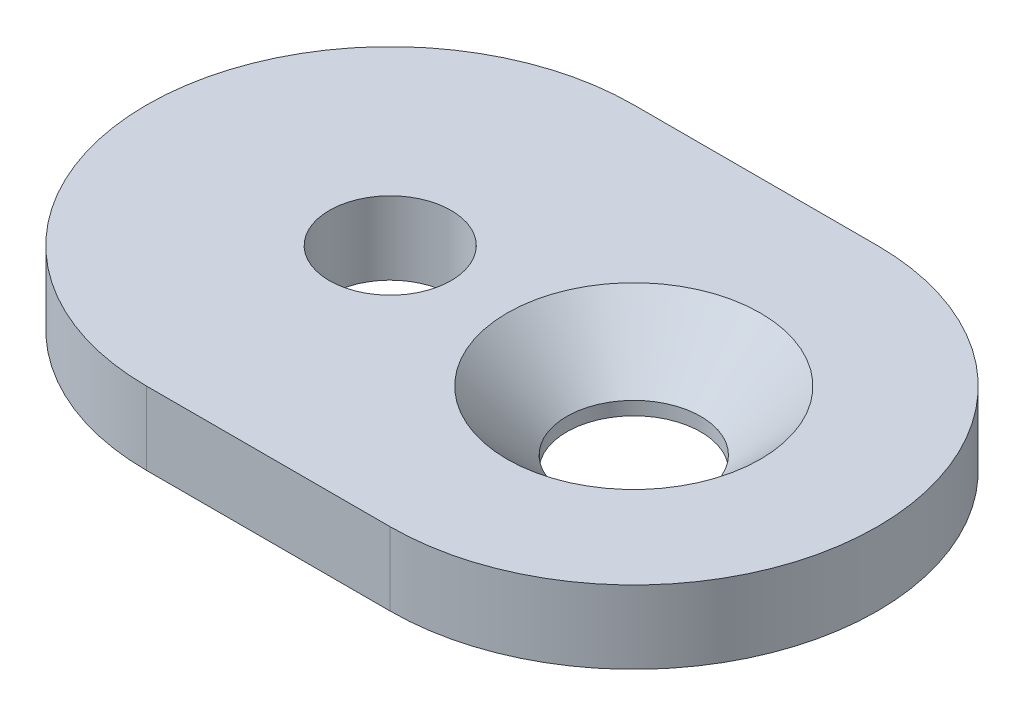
ISO-10303-21;
HEADER;
FILE_DESCRIPTION(('STEP AP214'),'2;1');
FILE_NAME('part.step','',(''),(''),'','','');
FILE_SCHEMA(('AUTOMOTIVE_DESIGN { 1 0 10303 214 1 1 1 1 }'));
ENDSEC;
DATA;
#1=APPLICATION_CONTEXT('core data for automotive mechanical design processes');
#2=APPLICATION_PROTOCOL_DEFINITION('international standard','automotive_design',2000,#1);
#3=PRODUCT_CONTEXT('',#1,'mechanical');
#4=PRODUCT('Part','Part','',(#3));
#5=PRODUCT_RELATED_PRODUCT_CATEGORY('part','',(#4));
#6=PRODUCT_DEFINITION_FORMATION('','',#4);
#7=PRODUCT_DEFINITION_CONTEXT('part definition',#1,'design');
#8=PRODUCT_DEFINITION('design','',#6,#7);
#9=PRODUCT_DEFINITION_SHAPE('','',#8);
#10=(LENGTH_UNIT() NAMED_UNIT(*) SI_UNIT(.MILLI.,.METRE.));
#11=(NAMED_UNIT(*) PLANE_ANGLE_UNIT() SI_UNIT($,.RADIAN.));
#12=(NAMED_UNIT(*) SI_UNIT($,.STERADIAN.) SOLID_ANGLE_UNIT());
#13=UNCERTAINTY_MEASURE_WITH_UNIT(LENGTH_MEASURE(1.E-05),#10,'distance_accuracy_value','');
#14=(GEOMETRIC_REPRESENTATION_CONTEXT(3) GLOBAL_UNCERTAINTY_ASSIGNED_CONTEXT((#13)) GLOBAL_UNIT_ASSIGNED_CONTEXT((#10,
#11,#12)) REPRESENTATION_CONTEXT('',''));
#15=CARTESIAN_POINT('',(0.,0.,0.));
#16=DIRECTION('',(0.,0.,1.));
#17=DIRECTION('',(1.,0.,0.));
#18=AXIS2_PLACEMENT_3D('',#15,#16,#17);
#19=CARTESIAN_POINT('',(10.,3.,0.));
#20=DIRECTION('',(0.,1.,0.));
#21=DIRECTION('',(0.,0.,1.));
#22=AXIS2_PLACEMENT_3D('',#19,#20,#21);
#23=PLANE('',#22);
#24=CARTESIAN_POINT('',(10.,3.,0.));
#25=DIRECTION('',(0.,1.,0.));
#26=DIRECTION('',(0.,0.,1.));
#27=AXIS2_PLACEMENT_3D('',#24,#25,#26);
#28=CIRCLE('',#27,5.2);
#29=CARTESIAN_POINT('',(10.,3.,5.2));
#30=VERTEX_POINT('',#29);
#31=EDGE_CURVE('E177',#30,#30,#28,.T.);
#32=ORIENTED_EDGE('',*,*,#31,.F.);
#33=EDGE_LOOP('',(#32));
#34=FACE_BOUND('',#33,.T.);
#35=CARTESIAN_POINT('',(0.,3.,0.));
#36=DIRECTION('',(0.,1.,0.));
#37=DIRECTION('',(0.,0.,1.));
#38=AXIS2_PLACEMENT_3D('',#35,#36,#37);
#39=CIRCLE('',#38,2.5);
#40=CARTESIAN_POINT('',(0.,3.,2.5));
#41=VERTEX_POINT('',#40);
#42=EDGE_CURVE('E90',#41,#41,#39,.T.);
#43=ORIENTED_EDGE('',*,*,#42,.F.);
#44=EDGE_LOOP('',(#43));
#45=FACE_BOUND('',#44,.T.);
#46=CARTESIAN_POINT('',(10.,3.,0.));
#47=DIRECTION('',(0.,1.,0.));
#48=DIRECTION('',(0.,0.,1.));
#49=AXIS2_PLACEMENT_3D('',#46,#47,#48);
#50=CIRCLE('',#49,10.);
#51=CARTESIAN_POINT('',(10.,3.,10.));
#52=VERTEX_POINT('',#51);
#53=CARTESIAN_POINT('',(10.,3.,-10.));
#54=VERTEX_POINT('',#53);
#55=EDGE_CURVE('E100',#52,#54,#50,.T.);
#56=ORIENTED_EDGE('',*,*,#55,.T.);
#57=DIRECTION('',(-1.,0.,0.));
#58=VECTOR('',#57,1.);
#59=CARTESIAN_POINT('',(10.,3.,-10.));
#60=LINE('',#59,#58);
#61=CARTESIAN_POINT('',(0.,3.,-10.));
#62=VERTEX_POINT('',#61);
#63=EDGE_CURVE('E85',#54,#62,#60,.T.);
#64=ORIENTED_EDGE('',*,*,#63,.T.);
#65=CARTESIAN_POINT('',(0.,3.,0.));
#66=DIRECTION('',(0.,1.,0.));
#67=DIRECTION('',(0.,0.,1.));
#68=AXIS2_PLACEMENT_3D('',#65,#66,#67);
#69=CIRCLE('',#68,10.);
#70=CARTESIAN_POINT('',(0.,3.,10.));
#71=VERTEX_POINT('',#70);
#72=EDGE_CURVE('E52',#62,#71,#69,.T.);
#73=ORIENTED_EDGE('',*,*,#72,.T.);
#74=DIRECTION('',(1.,0.,0.));
#75=VECTOR('',#74,1.);
#76=CARTESIAN_POINT('',(10.,3.,10.));
#77=LINE('',#76,#75);
#78=EDGE_CURVE('E47',#71,#52,#77,.T.);
#79=ORIENTED_EDGE('',*,*,#78,.T.);
#80=EDGE_LOOP('',(#56,#64,#73,#79));
#81=FACE_BOUND('',#80,.T.);
#82=ADVANCED_FACE('F32',(#34,#45,#81),#23,.T.);
#83=CARTESIAN_POINT('',(10.,0.,0.));
#84=DIRECTION('',(0.,1.,0.));
#85=DIRECTION('',(0.,0.,1.));
#86=AXIS2_PLACEMENT_3D('',#83,#84,#85);
#87=PLANE('',#86);
#88=CARTESIAN_POINT('',(10.,0.,0.));
#89=DIRECTION('',(0.,1.,0.));
#90=DIRECTION('',(0.,0.,1.));
#91=AXIS2_PLACEMENT_3D('',#88,#89,#90);
#92=CIRCLE('',#91,2.75);
#93=CARTESIAN_POINT('',(10.,0.,2.75));
#94=VERTEX_POINT('',#93);
#95=EDGE_CURVE('E184',#94,#94,#92,.T.);
#96=ORIENTED_EDGE('',*,*,#95,.T.);
#97=EDGE_LOOP('',(#96));
#98=FACE_BOUND('',#97,.T.);
#99=CARTESIAN_POINT('',(0.,0.,0.));
#100=DIRECTION('',(0.,1.,0.));
#101=DIRECTION('',(0.,0.,1.));
#102=AXIS2_PLACEMENT_3D('',#99,#100,#101);
#103=CIRCLE('',#102,2.5);
#104=CARTESIAN_POINT('',(0.,0.,2.5));
#105=VERTEX_POINT('',#104);
#106=EDGE_CURVE('E93',#105,#105,#103,.T.);
#107=ORIENTED_EDGE('',*,*,#106,.T.);
#108=EDGE_LOOP('',(#107));
#109=FACE_BOUND('',#108,.T.);
#110=CARTESIAN_POINT('',(10.,0.,0.));
#111=DIRECTION('',(0.,1.,0.));
#112=DIRECTION('',(0.,0.,1.));
#113=AXIS2_PLACEMENT_3D('',#110,#111,#112);
#114=CIRCLE('',#113,10.);
#115=CARTESIAN_POINT('',(10.,0.,10.));
#116=VERTEX_POINT('',#115);
#117=CARTESIAN_POINT('',(10.,0.,-10.));
#118=VERTEX_POINT('',#117);
#119=EDGE_CURVE('E77',#116,#118,#114,.T.);
#120=ORIENTED_EDGE('',*,*,#119,.F.);
#121=DIRECTION('',(1.,0.,0.));
#122=VECTOR('',#121,1.);
#123=CARTESIAN_POINT('',(10.,0.,10.));
#124=LINE('',#123,#122);
#125=CARTESIAN_POINT('',(0.,0.,10.));
#126=VERTEX_POINT('',#125);
#127=EDGE_CURVE('E98',#126,#116,#124,.T.);
#128=ORIENTED_EDGE('',*,*,#127,.F.);
#129=CARTESIAN_POINT('',(0.,0.,0.));
#130=DIRECTION('',(0.,1.,0.));
#131=DIRECTION('',(0.,0.,1.));
#132=AXIS2_PLACEMENT_3D('',#129,#130,#131);
#133=CIRCLE('',#132,10.);
#134=CARTESIAN_POINT('',(0.,0.,-10.));
#135=VERTEX_POINT('',#134);
#136=EDGE_CURVE('E78',#135,#126,#133,.T.);
#137=ORIENTED_EDGE('',*,*,#136,.F.);
#138=DIRECTION('',(-1.,0.,0.));
#139=VECTOR('',#138,1.);
#140=CARTESIAN_POINT('',(10.,0.,-10.));
#141=LINE('',#140,#139);
#142=EDGE_CURVE('E73',#118,#135,#141,.T.);
#143=ORIENTED_EDGE('',*,*,#142,.F.);
#144=EDGE_LOOP('',(#120,#128,#137,#143));
#145=FACE_BOUND('',#144,.T.);
#146=ADVANCED_FACE('F74',(#98,#109,#145),#87,.F.);
#147=CARTESIAN_POINT('',(10.,3.,0.));
#148=DIRECTION('',(0.,-1.,0.));
#149=DIRECTION('',(0.,0.,-1.));
#150=AXIS2_PLACEMENT_3D('',#147,#148,#149);
#151=CYLINDRICAL_SURFACE('',#150,10.);
#152=ORIENTED_EDGE('',*,*,#119,.T.);
#153=DIRECTION('',(0.,-1.,0.));
#154=VECTOR('',#153,1.);
#155=CARTESIAN_POINT('',(10.,3.,-10.));
#156=LINE('',#155,#154);
#157=EDGE_CURVE('E11',#54,#118,#156,.T.);
#158=ORIENTED_EDGE('',*,*,#157,.F.);
#159=ORIENTED_EDGE('',*,*,#55,.F.);
#160=DIRECTION('',(0.,-1.,0.));
#161=VECTOR('',#160,1.);
#162=CARTESIAN_POINT('',(10.,3.,10.));
#163=LINE('',#162,#161);
#164=EDGE_CURVE('E89',#52,#116,#163,.T.);
#165=ORIENTED_EDGE('',*,*,#164,.T.);
#166=EDGE_LOOP('',(#152,#158,#159,#165));
#167=FACE_BOUND('',#166,.T.);
#168=ADVANCED_FACE('F34',(#167),#151,.T.);
#169=CARTESIAN_POINT('',(10.,3.,-10.));
#170=DIRECTION('',(0.,0.,1.));
#171=DIRECTION('',(1.,0.,0.));
#172=AXIS2_PLACEMENT_3D('',#169,#170,#171);
#173=PLANE('',#172);
#174=ORIENTED_EDGE('',*,*,#142,.T.);
#175=DIRECTION('',(0.,-1.,0.));
#176=VECTOR('',#175,1.);
#177=CARTESIAN_POINT('',(0.,3.,-10.));
#178=LINE('',#177,#176);
#179=EDGE_CURVE('E40',#62,#135,#178,.T.);
#180=ORIENTED_EDGE('',*,*,#179,.F.);
#181=ORIENTED_EDGE('',*,*,#63,.F.);
#182=ORIENTED_EDGE('',*,*,#157,.T.);
#183=EDGE_LOOP('',(#174,#180,#181,#182));
#184=FACE_BOUND('',#183,.T.);
#185=ADVANCED_FACE('F84',(#184),#173,.F.);
#186=CARTESIAN_POINT('',(0.,3.,0.));
#187=DIRECTION('',(0.,-1.,0.));
#188=DIRECTION('',(0.,0.,-1.));
#189=AXIS2_PLACEMENT_3D('',#186,#187,#188);
#190=CYLINDRICAL_SURFACE('',#189,10.);
#191=ORIENTED_EDGE('',*,*,#136,.T.);
#192=DIRECTION('',(0.,-1.,0.));
#193=VECTOR('',#192,1.);
#194=CARTESIAN_POINT('',(0.,3.,10.));
#195=LINE('',#194,#193);
#196=EDGE_CURVE('E106',#71,#126,#195,.T.);
#197=ORIENTED_EDGE('',*,*,#196,.F.);
#198=ORIENTED_EDGE('',*,*,#72,.F.);
#199=ORIENTED_EDGE('',*,*,#179,.T.);
#200=EDGE_LOOP('',(#191,#197,#198,#199));
#201=FACE_BOUND('',#200,.T.);
#202=ADVANCED_FACE('F109',(#201),#190,.T.);
#203=CARTESIAN_POINT('',(10.,3.,10.));
#204=DIRECTION('',(0.,0.,-1.));
#205=DIRECTION('',(-1.,0.,0.));
#206=AXIS2_PLACEMENT_3D('',#203,#204,#205);
#207=PLANE('',#206);
#208=ORIENTED_EDGE('',*,*,#127,.T.);
#209=ORIENTED_EDGE('',*,*,#164,.F.);
#210=ORIENTED_EDGE('',*,*,#78,.F.);
#211=ORIENTED_EDGE('',*,*,#196,.T.);
#212=EDGE_LOOP('',(#208,#209,#210,#211));
#213=FACE_BOUND('',#212,.T.);
#214=ADVANCED_FACE('F111',(#213),#207,.F.);
#215=CARTESIAN_POINT('',(0.,3.,0.));
#216=DIRECTION('',(0.,-1.,0.));
#217=DIRECTION('',(0.,0.,-1.));
#218=AXIS2_PLACEMENT_3D('',#215,#216,#217);
#219=CYLINDRICAL_SURFACE('',#218,2.5);
#220=ORIENTED_EDGE('',*,*,#42,.T.);
#221=EDGE_LOOP('',(#220));
#222=FACE_BOUND('',#221,.T.);
#223=ORIENTED_EDGE('',*,*,#106,.F.);
#224=EDGE_LOOP('',(#223));
#225=FACE_BOUND('',#224,.T.);
#226=ADVANCED_FACE('F126',(#222,#225),#219,.F.);
#227=CARTESIAN_POINT('',(10.,3.,0.));
#228=DIRECTION('',(0.,1.,0.));
#229=DIRECTION('',(0.,0.,1.));
#230=AXIS2_PLACEMENT_3D('',#227,#228,#229);
#231=CONICAL_SURFACE('',#230,5.2,0.785398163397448);
#232=CARTESIAN_POINT('',(10.,0.549999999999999,0.));
#233=DIRECTION('',(0.,1.,0.));
#234=DIRECTION('',(0.,0.,1.));
#235=AXIS2_PLACEMENT_3D('',#232,#233,#234);
#236=CIRCLE('',#235,2.75);
#237=CARTESIAN_POINT('',(10.,0.549999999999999,2.75));
#238=VERTEX_POINT('',#237);
#239=EDGE_CURVE('E179',#238,#238,#236,.T.);
#240=ORIENTED_EDGE('',*,*,#239,.F.);
#241=EDGE_LOOP('',(#240));
#242=FACE_BOUND('',#241,.T.);
#243=ORIENTED_EDGE('',*,*,#31,.T.);
#244=EDGE_LOOP('',(#243));
#245=FACE_BOUND('',#244,.T.);
#246=ADVANCED_FACE('F146',(#242,#245),#231,.F.);
#247=CARTESIAN_POINT('',(10.,3.,0.));
#248=DIRECTION('',(0.,1.,0.));
#249=DIRECTION('',(0.,0.,1.));
#250=AXIS2_PLACEMENT_3D('',#247,#248,#249);
#251=CYLINDRICAL_SURFACE('',#250,2.75);
#252=ORIENTED_EDGE('',*,*,#95,.F.);
#253=EDGE_LOOP('',(#252));
#254=FACE_BOUND('',#253,.T.);
#255=ORIENTED_EDGE('',*,*,#239,.T.);
#256=EDGE_LOOP('',(#255));
#257=FACE_BOUND('',#256,.T.);
#258=ADVANCED_FACE('F151',(#254,#257),#251,.F.);
#259=CLOSED_SHELL('',(#82,#146,#168,#185,#202,#214,#226,#246,#258));
#260=MANIFOLD_SOLID_BREP('B2',#259);
#261=ADVANCED_BREP_SHAPE_REPRESENTATION('',(#18,#260),#14);
#262=SHAPE_DEFINITION_REPRESENTATION(#9,#261);
ENDSEC;
END-ISO-10303-21;
